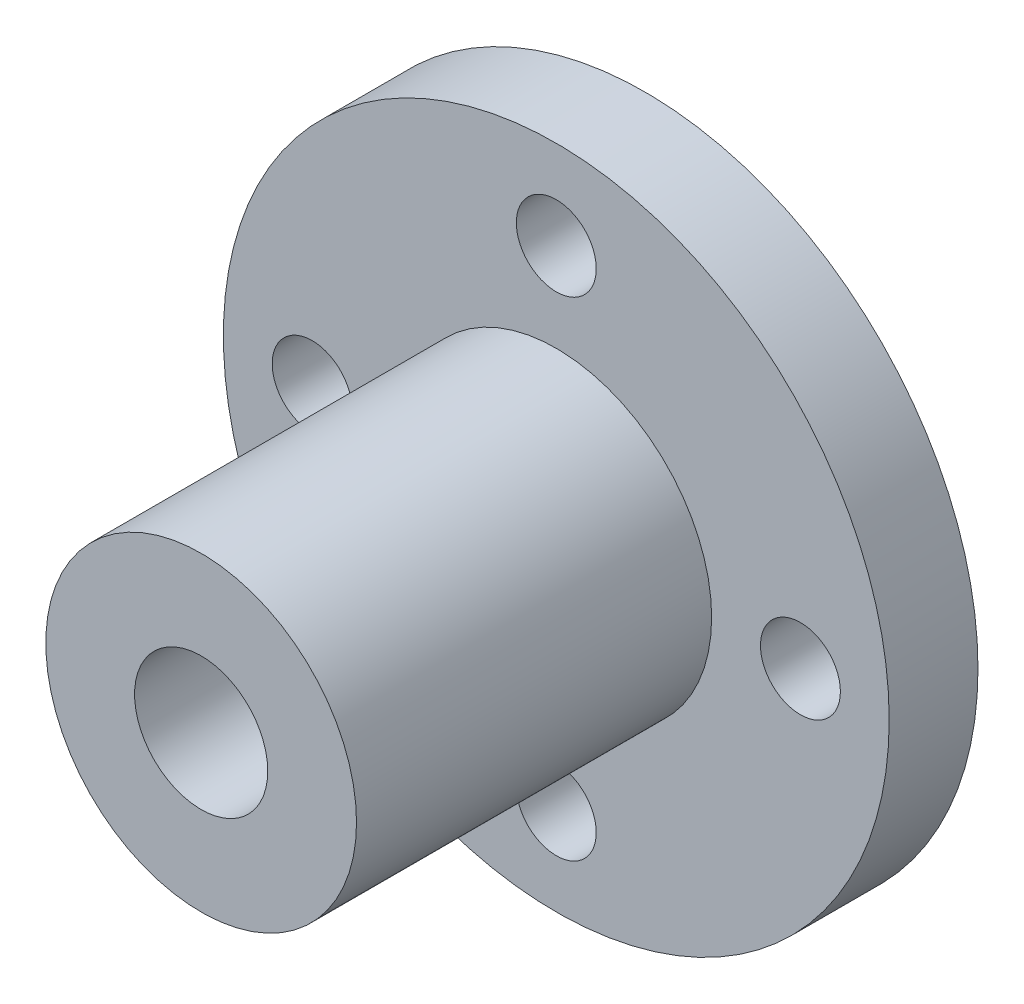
from build123d import *

# Parameters (mm, degrees)
CIRPATTERN1_COUNT = 4


with BuildPart() as part:
    # Sketch1 → Revolve1 (revolve)
    with BuildSketch(Plane(origin=(0, 0, 0), x_dir=(0, 0, -1), z_dir=(1, 0, 0)), mode=Mode.PRIVATE) as revolve1_sk:
        Polygon((50, 7.5), (0, 7.5), (0, 17.5), (40, 17.5), (40, 37.5), (50, 37.5), align=None)
    revolve(revolve1_sk.sketch.rotate(Axis((0, 0, 0), (0, 0, -1)), 90), axis=Axis((0, 0, 0), (0, 0, -1)))

    # Sketch2 → M10x1.0 Tapped Hole1 (revolve, cut)
    with BuildSketch(Plane(origin=(0, 27.5, -40), x_dir=(0, -1, 0), z_dir=(1, 0, 0))):
        Polygon((0, 0), (0, 25.703872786), (4.5, 23), (4.5, 0), align=None)
    m10x1_0_tapped_hole1 = revolve(axis=Axis((0, 27.5, -33.65), (0, 0, -1)), mode=Mode.SUBTRACT)

    # CirPattern1: M10x1.0 Tapped Hole1 ×4 about axis
    cirpattern1_axis = Axis((0, 0, 0), (0, 0, 1))
    for i in range(1, CIRPATTERN1_COUNT):
        add(m10x1_0_tapped_hole1.rotate(cirpattern1_axis, i * 360 / CIRPATTERN1_COUNT), mode=Mode.SUBTRACT)


solid = part.part
